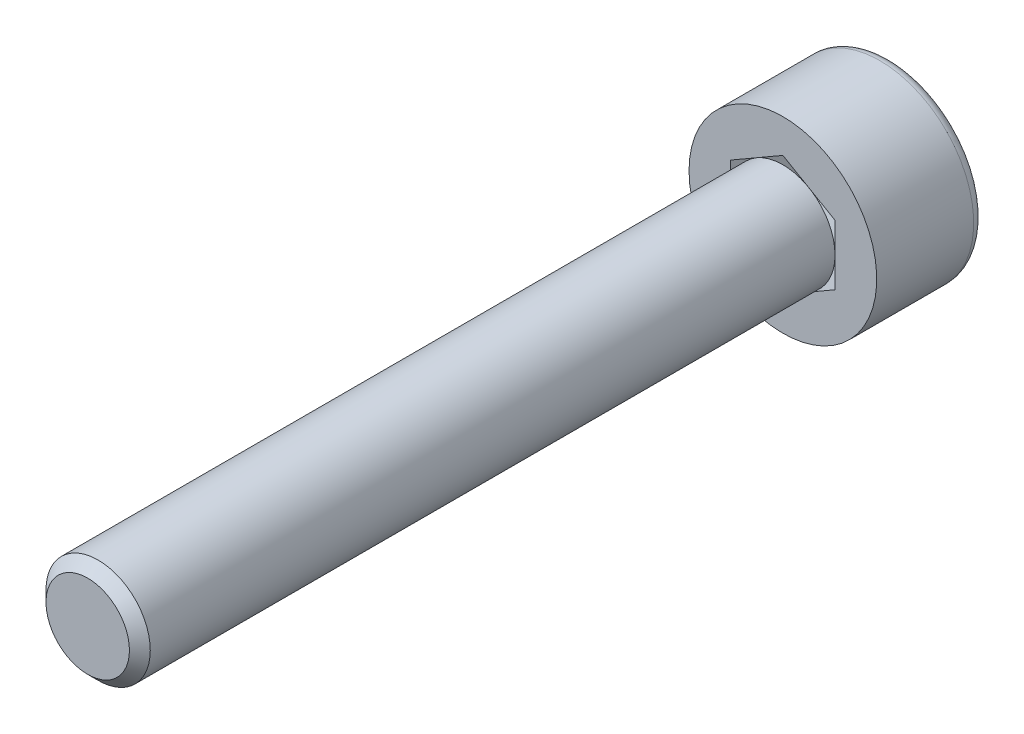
from build123d import *

# Parameters (mm, degrees)
ENLEV_MAT_EXTRU1_DEPTH = 7
ESQUISSE3_W            = 1.5
ESQUISSE3_H            = 20
CHANFREIN1_SIZE        = 0.3


with BuildPart() as part:
    # Esquisse1 → Base-R_volution (revolve)
    with BuildSketch(Plane(origin=(0, 0, 0), x_dir=(1, 0, 0), z_dir=(0, 1, 0)), mode=Mode.PRIVATE) as base_r_volution_sk:
        with BuildLine():
            Line((0, 0), (2.7, 0))
            Line((2.7, 0), (2.7, 2.79))
            ThreePointArc((2.7, 2.79), (2.609203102, 3.009203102), (2.39, 3.1))
            Line((2.39, 3.1), (0, 3.1))
            Line((0, 3.1), (0, 0))
        make_face()
    revolve(base_r_volution_sk.sketch.rotate(Axis((0, 0, 0), (0, 0, -1)), 180), axis=Axis((0, 0, 0), (0, 0, -1)))

    # Esquisse2 → enlev-mat-Extru1 (cut)
    with BuildSketch(Plane.XY.offset(-3.1)):
        Polygon((1.5, -0.866025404), (1.5, 0.866025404), (0, 1.732050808), (-1.5, 0.866025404), (-1.5, -0.866025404), (0, -1.732050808), align=None)
    extrude(amount=ENLEV_MAT_EXTRU1_DEPTH, mode=Mode.SUBTRACT)


with BuildPart() as body_2:
    # Esquisse3 → Boss.-R_vol.1 (revolve)
    with BuildSketch(Plane(origin=(0, 0, 0), x_dir=(1, 0, 0), z_dir=(0, 1, 0))):
        with Locations((0.75, -10)):
            Rectangle(ESQUISSE3_W, ESQUISSE3_H)
    revolve(axis=Axis((0, 0, 0), (0, 0, 1)))

    # Chanfrein1
    chanfrein1_edges = [body_2.edges().sort_by_distance(p)[0] for p in [
        (-1.5, 0, 20),
    ]]
    chamfer(chanfrein1_edges, length=CHANFREIN1_SIZE)


solid = Compound([part.part, body_2.part])
